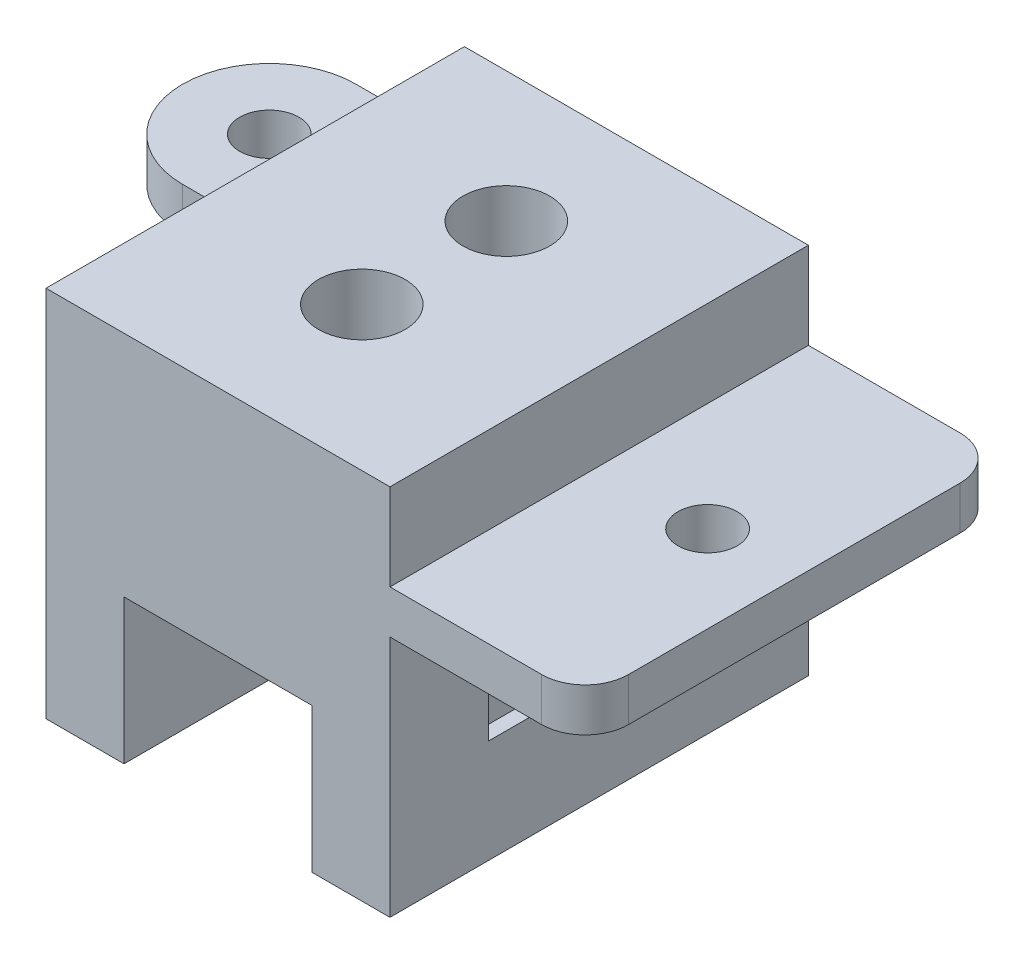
from build123d import *

# Parameters (mm, degrees)
BOSS_EXTRUDE1_DEPTH = 28.95
SKETCH2_R           = 3
CUT_EXTRUDE1_DEPTH  = 28
SKETCH3_R           = 2.05
BOSS_EXTRUDE2_DEPTH = 3
CUT_EXTRUDE2_DEPTH  = 1


with BuildPart() as part:
    # Sketch1 → Boss-Extrude1 (new body)
    with BuildSketch(Plane.XY):
        Polygon((0, 0), (0, 25.8), (23.8, 25.8), (23.8, 0), (18.4, 0), (18.4, 10), (5.4, 10), (5.4, 0), align=None)
    extrude(amount=BOSS_EXTRUDE1_DEPTH)

    # Sketch2 → Cut-Extrude1 (cut)
    with BuildSketch(Plane(origin=(0, 25.8, 0), x_dir=(1, 0, 0), z_dir=(0, 1, 0))):
        with Locations(Location((11.9, -9, 0), (0, 0, 270))):
            Circle(SKETCH2_R)
        with Locations(Location((11.9, -19, 0), (0, 0, 270))):
            Circle(SKETCH2_R)
    extrude(amount=-CUT_EXTRUDE1_DEPTH, mode=Mode.SUBTRACT)

    # Sketch3 → Boss-Extrude2 (add)
    # profile 1 of 2: a face of its own
    with BuildSketch(Plane(origin=(0, 19.8, 0), x_dir=(1, 0, 0), z_dir=(0, 1, 0))):
        with BuildLine():
            Line((0, 0), (-7.5, 0))
            ThreePointArc((-7.5, 0), (-13.5, -6), (-7.5, -12))
            Line((-7.5, -12), (0, -12))
            Line((0, -12), (0, 0))
        make_face()
        with Locations(Location((-7.5, -6, 0), (0, 0, 270))):
            Circle(SKETCH3_R, mode=Mode.SUBTRACT)
    # profile 2 of 2: a face of its own
    with BuildSketch(Plane(origin=(0, 19.8, 0), x_dir=(1, 0, 0), z_dir=(0, 1, 0))):
        with BuildLine():
            Line((23.8, 0), (34.3, 0))
            ThreePointArc((34.3, 0), (36.421320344, -0.878679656), (37.3, -3))
            Line((37.3, -3), (37.3, -25.95))
            ThreePointArc((37.3, -25.95), (36.421320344, -28.071320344), (34.3, -28.95))
            Line((34.3, -28.95), (23.8, -28.95))
            Line((23.8, -28.95), (23.8, 0))
        make_face()
        with Locations(Location((31.3, -14.475, 0), (0, 0, 270))):
            Circle(SKETCH3_R, mode=Mode.SUBTRACT)
    extrude(amount=-BOSS_EXTRUDE2_DEPTH)

    # Sketch7 → Cut-Extrude2 (cut)
    with BuildSketch(Plane.ZY):
        Polygon((11.215348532, 11.696557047), (11.215348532, 13.857068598), (6.577886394, 9.427139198), (11.215348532, 4.997209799), (11.215348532, 7.157721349), (22.138241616, 7.157721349), (22.138241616, 11.696557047), align=None)
    cut_extrude2 = extrude(amount=-CUT_EXTRUDE2_DEPTH, mode=Mode.SUBTRACT)

    # Mirror1: Cut-Extrude2 across plane
    add(cut_extrude2.mirror(Plane(origin=(11.9, 0, 0), x_dir=(0, 0, 1), z_dir=(1, 0, 0))), mode=Mode.SUBTRACT)


solid = part.part
